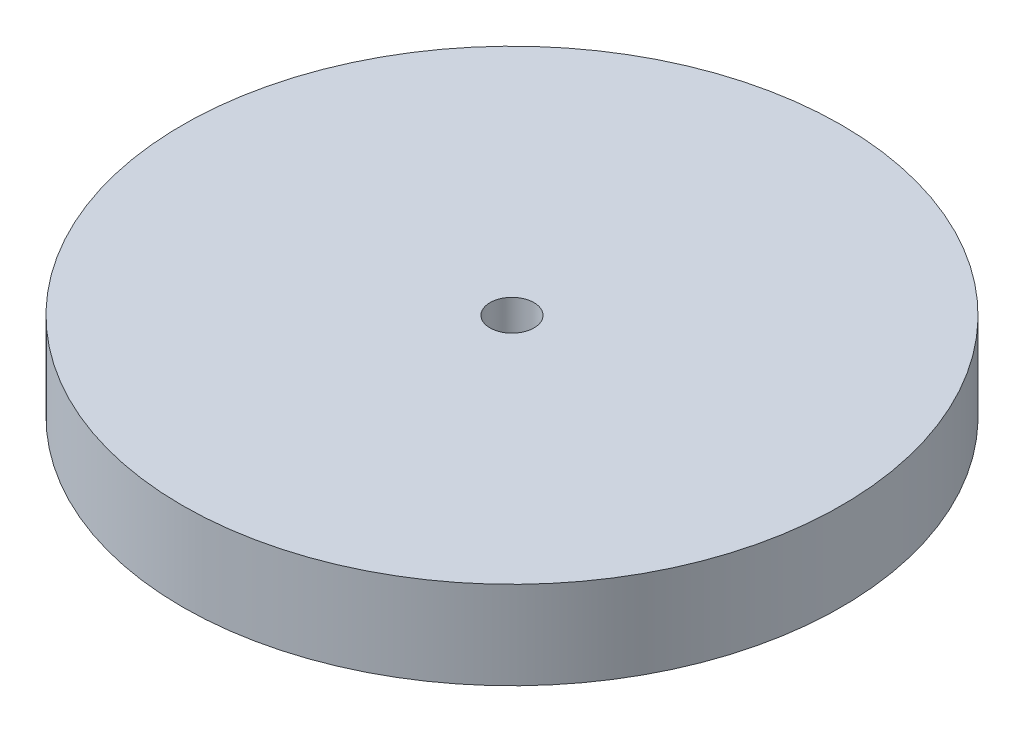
ISO-10303-21;
HEADER;
FILE_DESCRIPTION(('STEP AP214'),'2;1');
FILE_NAME('part.step','',(''),(''),'','','');
FILE_SCHEMA(('AUTOMOTIVE_DESIGN { 1 0 10303 214 1 1 1 1 }'));
ENDSEC;
DATA;
#1=APPLICATION_CONTEXT('core data for automotive mechanical design processes');
#2=APPLICATION_PROTOCOL_DEFINITION('international standard','automotive_design',2000,#1);
#3=PRODUCT_CONTEXT('',#1,'mechanical');
#4=PRODUCT('Part','Part','',(#3));
#5=PRODUCT_RELATED_PRODUCT_CATEGORY('part','',(#4));
#6=PRODUCT_DEFINITION_FORMATION('','',#4);
#7=PRODUCT_DEFINITION_CONTEXT('part definition',#1,'design');
#8=PRODUCT_DEFINITION('design','',#6,#7);
#9=PRODUCT_DEFINITION_SHAPE('','',#8);
#10=(LENGTH_UNIT() NAMED_UNIT(*) SI_UNIT(.MILLI.,.METRE.));
#11=(NAMED_UNIT(*) PLANE_ANGLE_UNIT() SI_UNIT($,.RADIAN.));
#12=(NAMED_UNIT(*) SI_UNIT($,.STERADIAN.) SOLID_ANGLE_UNIT());
#13=UNCERTAINTY_MEASURE_WITH_UNIT(LENGTH_MEASURE(1.E-05),#10,'distance_accuracy_value','');
#14=(GEOMETRIC_REPRESENTATION_CONTEXT(3) GLOBAL_UNCERTAINTY_ASSIGNED_CONTEXT((#13)) GLOBAL_UNIT_ASSIGNED_CONTEXT((#10,
#11,#12)) REPRESENTATION_CONTEXT('',''));
#15=CARTESIAN_POINT('',(0.,0.,0.));
#16=DIRECTION('',(0.,0.,1.));
#17=DIRECTION('',(1.,0.,0.));
#18=AXIS2_PLACEMENT_3D('',#15,#16,#17);
#19=CARTESIAN_POINT('',(0.,0.,0.));
#20=DIRECTION('',(0.,-1.,0.));
#21=DIRECTION('',(0.,0.,-1.));
#22=AXIS2_PLACEMENT_3D('',#19,#20,#21);
#23=CYLINDRICAL_SURFACE('',#22,5.);
#24=CARTESIAN_POINT('',(0.,20.,0.));
#25=DIRECTION('',(0.,-1.,0.));
#26=DIRECTION('',(0.,0.,-1.));
#27=AXIS2_PLACEMENT_3D('',#24,#25,#26);
#28=CIRCLE('',#27,5.);
#29=CARTESIAN_POINT('',(0.,20.,-5.));
#30=VERTEX_POINT('',#29);
#31=EDGE_CURVE('E10',#30,#30,#28,.T.);
#32=ORIENTED_EDGE('',*,*,#31,.F.);
#33=EDGE_LOOP('',(#32));
#34=FACE_BOUND('',#33,.T.);
#35=CARTESIAN_POINT('',(0.,0.,0.));
#36=DIRECTION('',(0.,-1.,0.));
#37=DIRECTION('',(0.,0.,-1.));
#38=AXIS2_PLACEMENT_3D('',#35,#36,#37);
#39=CIRCLE('',#38,5.);
#40=CARTESIAN_POINT('',(0.,0.,-5.));
#41=VERTEX_POINT('',#40);
#42=EDGE_CURVE('E45',#41,#41,#39,.T.);
#43=ORIENTED_EDGE('',*,*,#42,.T.);
#44=EDGE_LOOP('',(#43));
#45=FACE_BOUND('',#44,.T.);
#46=ADVANCED_FACE('F31',(#34,#45),#23,.F.);
#47=CARTESIAN_POINT('',(-5.,20.,0.));
#48=DIRECTION('',(0.,-1.,0.));
#49=DIRECTION('',(0.,0.,-1.));
#50=AXIS2_PLACEMENT_3D('',#47,#48,#49);
#51=PLANE('',#50);
#52=CARTESIAN_POINT('',(0.,20.,0.));
#53=DIRECTION('',(0.,-1.,0.));
#54=DIRECTION('',(0.,0.,-1.));
#55=AXIS2_PLACEMENT_3D('',#52,#53,#54);
#56=CIRCLE('',#55,75.);
#57=CARTESIAN_POINT('',(0.,20.,-75.));
#58=VERTEX_POINT('',#57);
#59=EDGE_CURVE('E37',#58,#58,#56,.T.);
#60=ORIENTED_EDGE('',*,*,#59,.F.);
#61=EDGE_LOOP('',(#60));
#62=FACE_BOUND('',#61,.T.);
#63=ORIENTED_EDGE('',*,*,#31,.T.);
#64=EDGE_LOOP('',(#63));
#65=FACE_BOUND('',#64,.T.);
#66=ADVANCED_FACE('F60',(#62,#65),#51,.F.);
#67=CARTESIAN_POINT('',(0.,0.,0.));
#68=DIRECTION('',(0.,-1.,0.));
#69=DIRECTION('',(0.,0.,-1.));
#70=AXIS2_PLACEMENT_3D('',#67,#68,#69);
#71=CYLINDRICAL_SURFACE('',#70,75.);
#72=CARTESIAN_POINT('',(0.,0.,0.));
#73=DIRECTION('',(0.,-1.,0.));
#74=DIRECTION('',(0.,0.,-1.));
#75=AXIS2_PLACEMENT_3D('',#72,#73,#74);
#76=CIRCLE('',#75,75.);
#77=CARTESIAN_POINT('',(0.,0.,-75.));
#78=VERTEX_POINT('',#77);
#79=EDGE_CURVE('E41',#78,#78,#76,.T.);
#80=ORIENTED_EDGE('',*,*,#79,.F.);
#81=EDGE_LOOP('',(#80));
#82=FACE_BOUND('',#81,.T.);
#83=ORIENTED_EDGE('',*,*,#59,.T.);
#84=EDGE_LOOP('',(#83));
#85=FACE_BOUND('',#84,.T.);
#86=ADVANCED_FACE('F55',(#82,#85),#71,.T.);
#87=CARTESIAN_POINT('',(-5.,0.,0.));
#88=DIRECTION('',(0.,1.,0.));
#89=DIRECTION('',(0.,0.,1.));
#90=AXIS2_PLACEMENT_3D('',#87,#88,#89);
#91=PLANE('',#90);
#92=ORIENTED_EDGE('',*,*,#42,.F.);
#93=EDGE_LOOP('',(#92));
#94=FACE_BOUND('',#93,.T.);
#95=ORIENTED_EDGE('',*,*,#79,.T.);
#96=EDGE_LOOP('',(#95));
#97=FACE_BOUND('',#96,.T.);
#98=ADVANCED_FACE('F52',(#94,#97),#91,.F.);
#99=CLOSED_SHELL('',(#46,#66,#86,#98));
#100=MANIFOLD_SOLID_BREP('B2',#99);
#101=ADVANCED_BREP_SHAPE_REPRESENTATION('',(#18,#100),#14);
#102=SHAPE_DEFINITION_REPRESENTATION(#9,#101);
ENDSEC;
END-ISO-10303-21;
